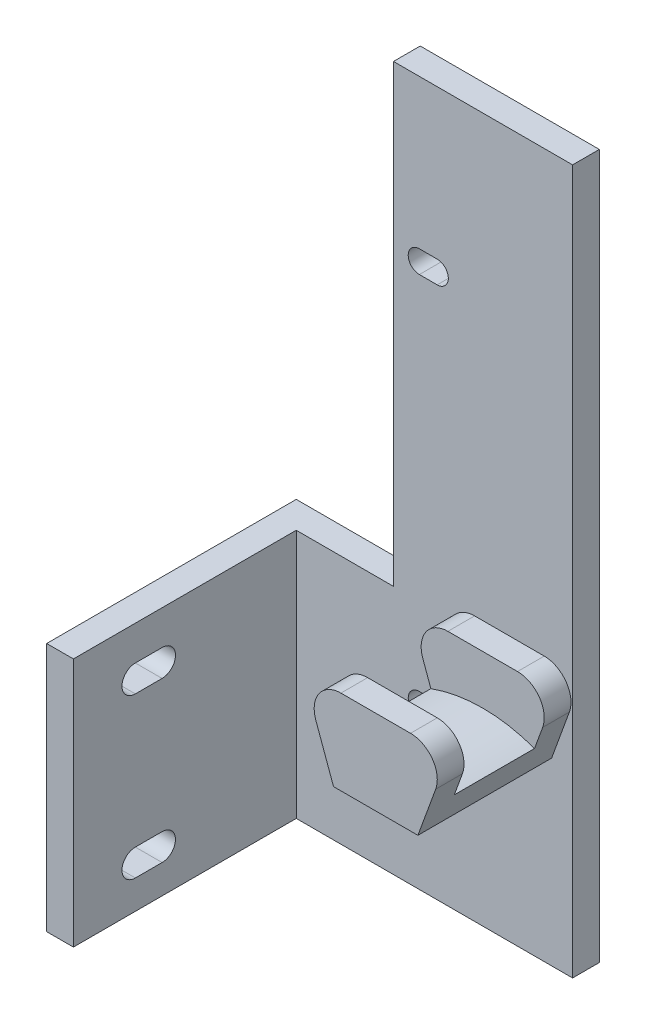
ISO-10303-21;
HEADER;
FILE_DESCRIPTION(('STEP AP214'),'2;1');
FILE_NAME('part.step','',(''),(''),'','','');
FILE_SCHEMA(('AUTOMOTIVE_DESIGN { 1 0 10303 214 1 1 1 1 }'));
ENDSEC;
DATA;
#1=APPLICATION_CONTEXT('core data for automotive mechanical design processes');
#2=APPLICATION_PROTOCOL_DEFINITION('international standard','automotive_design',2000,#1);
#3=PRODUCT_CONTEXT('',#1,'mechanical');
#4=PRODUCT('Part','Part','',(#3));
#5=PRODUCT_RELATED_PRODUCT_CATEGORY('part','',(#4));
#6=PRODUCT_DEFINITION_FORMATION('','',#4);
#7=PRODUCT_DEFINITION_CONTEXT('part definition',#1,'design');
#8=PRODUCT_DEFINITION('design','',#6,#7);
#9=PRODUCT_DEFINITION_SHAPE('','',#8);
#10=(LENGTH_UNIT() NAMED_UNIT(*) SI_UNIT(.MILLI.,.METRE.));
#11=(NAMED_UNIT(*) PLANE_ANGLE_UNIT() SI_UNIT($,.RADIAN.));
#12=(NAMED_UNIT(*) SI_UNIT($,.STERADIAN.) SOLID_ANGLE_UNIT());
#13=UNCERTAINTY_MEASURE_WITH_UNIT(LENGTH_MEASURE(1.E-05),#10,'distance_accuracy_value','');
#14=(GEOMETRIC_REPRESENTATION_CONTEXT(3) GLOBAL_UNCERTAINTY_ASSIGNED_CONTEXT((#13)) GLOBAL_UNIT_ASSIGNED_CONTEXT((#10,
#11,#12)) REPRESENTATION_CONTEXT('',''));
#15=CARTESIAN_POINT('',(0.,0.,0.));
#16=DIRECTION('',(0.,0.,1.));
#17=DIRECTION('',(1.,0.,0.));
#18=AXIS2_PLACEMENT_3D('',#15,#16,#17);
#19=CARTESIAN_POINT('',(0.,0.,3.));
#20=DIRECTION('',(0.,0.,1.));
#21=DIRECTION('',(1.,0.,0.));
#22=AXIS2_PLACEMENT_3D('',#19,#20,#21);
#23=PLANE('',#22);
#24=CARTESIAN_POINT('',(-17.1899572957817,-18.,3.));
#25=DIRECTION('',(0.,0.,1.));
#26=DIRECTION('',(1.,0.,0.));
#27=AXIS2_PLACEMENT_3D('',#24,#25,#26);
#28=CIRCLE('',#27,1.25);
#29=CARTESIAN_POINT('',(-17.1899572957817,-16.75,3.));
#30=VERTEX_POINT('',#29);
#31=CARTESIAN_POINT('',(-17.1899572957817,-19.25,3.));
#32=VERTEX_POINT('',#31);
#33=EDGE_CURVE('E336',#30,#32,#28,.T.);
#34=ORIENTED_EDGE('',*,*,#33,.F.);
#35=DIRECTION('',(-1.,0.,0.));
#36=VECTOR('',#35,1.);
#37=CARTESIAN_POINT('',(0.,-16.75,3.));
#38=LINE('',#37,#36);
#39=CARTESIAN_POINT('',(-15.1899572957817,-16.75,3.));
#40=VERTEX_POINT('',#39);
#41=EDGE_CURVE('E331',#40,#30,#38,.T.);
#42=ORIENTED_EDGE('',*,*,#41,.F.);
#43=CARTESIAN_POINT('',(-15.1899572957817,-18.,3.));
#44=DIRECTION('',(0.,0.,1.));
#45=DIRECTION('',(1.,0.,0.));
#46=AXIS2_PLACEMENT_3D('',#43,#44,#45);
#47=CIRCLE('',#46,1.25);
#48=CARTESIAN_POINT('',(-15.1899572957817,-19.25,3.));
#49=VERTEX_POINT('',#48);
#50=EDGE_CURVE('E279',#49,#40,#47,.T.);
#51=ORIENTED_EDGE('',*,*,#50,.F.);
#52=DIRECTION('',(1.,0.,0.));
#53=VECTOR('',#52,1.);
#54=CARTESIAN_POINT('',(0.,-19.25,3.));
#55=LINE('',#54,#53);
#56=EDGE_CURVE('E334',#32,#49,#55,.T.);
#57=ORIENTED_EDGE('',*,*,#56,.F.);
#58=EDGE_LOOP('',(#34,#42,#51,#57));
#59=FACE_BOUND('',#58,.T.);
#60=CARTESIAN_POINT('',(-17.1899572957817,-61.0102023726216,3.));
#61=DIRECTION('',(0.,0.,1.));
#62=DIRECTION('',(1.,0.,0.));
#63=AXIS2_PLACEMENT_3D('',#60,#61,#62);
#64=CIRCLE('',#63,1.25);
#65=CARTESIAN_POINT('',(-17.1899572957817,-59.7602023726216,3.));
#66=VERTEX_POINT('',#65);
#67=CARTESIAN_POINT('',(-17.1899572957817,-62.2602023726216,3.));
#68=VERTEX_POINT('',#67);
#69=EDGE_CURVE('E329',#66,#68,#64,.T.);
#70=ORIENTED_EDGE('',*,*,#69,.F.);
#71=DIRECTION('',(-1.,0.,0.));
#72=VECTOR('',#71,1.);
#73=CARTESIAN_POINT('',(0.,-59.7602023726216,3.));
#74=LINE('',#73,#72);
#75=CARTESIAN_POINT('',(-15.1899572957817,-59.7602023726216,3.));
#76=VERTEX_POINT('',#75);
#77=EDGE_CURVE('E303',#76,#66,#74,.T.);
#78=ORIENTED_EDGE('',*,*,#77,.F.);
#79=CARTESIAN_POINT('',(-15.1899572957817,-61.0102023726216,3.));
#80=DIRECTION('',(0.,0.,1.));
#81=DIRECTION('',(1.,0.,0.));
#82=AXIS2_PLACEMENT_3D('',#79,#80,#81);
#83=CIRCLE('',#82,1.25);
#84=CARTESIAN_POINT('',(-15.1899572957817,-62.2602023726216,3.));
#85=VERTEX_POINT('',#84);
#86=EDGE_CURVE('E325',#85,#76,#83,.T.);
#87=ORIENTED_EDGE('',*,*,#86,.F.);
#88=DIRECTION('',(1.,0.,0.));
#89=VECTOR('',#88,1.);
#90=CARTESIAN_POINT('',(0.,-62.2602023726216,3.));
#91=LINE('',#90,#89);
#92=EDGE_CURVE('E327',#68,#85,#91,.T.);
#93=ORIENTED_EDGE('',*,*,#92,.F.);
#94=EDGE_LOOP('',(#70,#78,#87,#93));
#95=FACE_BOUND('',#94,.T.);
#96=DIRECTION('',(0.,1.,0.));
#97=VECTOR('',#96,1.);
#98=CARTESIAN_POINT('',(-20.0928276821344,0.,3.));
#99=LINE('',#98,#97);
#100=CARTESIAN_POINT('',(-20.0928276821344,-51.,3.));
#101=VERTEX_POINT('',#100);
#102=CARTESIAN_POINT('',(-20.0928276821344,0.,3.));
#103=VERTEX_POINT('',#102);
#104=EDGE_CURVE('E405',#101,#103,#99,.T.);
#105=ORIENTED_EDGE('',*,*,#104,.F.);
#106=DIRECTION('',(1.,0.,0.));
#107=VECTOR('',#106,1.);
#108=CARTESIAN_POINT('',(-34.,-51.,3.));
#109=LINE('',#108,#107);
#110=CARTESIAN_POINT('',(-31.,-51.,3.));
#111=VERTEX_POINT('',#110);
#112=EDGE_CURVE('E402',#111,#101,#109,.T.);
#113=ORIENTED_EDGE('',*,*,#112,.F.);
#114=DIRECTION('',(0.,1.,0.));
#115=VECTOR('',#114,1.);
#116=CARTESIAN_POINT('',(-31.,-51.,3.));
#117=LINE('',#116,#115);
#118=CARTESIAN_POINT('',(-31.,-79.,3.));
#119=VERTEX_POINT('',#118);
#120=EDGE_CURVE('E481',#119,#111,#117,.T.);
#121=ORIENTED_EDGE('',*,*,#120,.F.);
#122=DIRECTION('',(1.,0.,0.));
#123=VECTOR('',#122,1.);
#124=CARTESIAN_POINT('',(-34.,-79.,3.));
#125=LINE('',#124,#123);
#126=CARTESIAN_POINT('',(0.,-79.,3.));
#127=VERTEX_POINT('',#126);
#128=EDGE_CURVE('E522',#119,#127,#125,.T.);
#129=ORIENTED_EDGE('',*,*,#128,.T.);
#130=DIRECTION('',(0.,1.,0.));
#131=VECTOR('',#130,1.);
#132=CARTESIAN_POINT('',(0.,0.,3.));
#133=LINE('',#132,#131);
#134=CARTESIAN_POINT('',(0.,0.,3.));
#135=VERTEX_POINT('',#134);
#136=EDGE_CURVE('E524',#127,#135,#133,.T.);
#137=ORIENTED_EDGE('',*,*,#136,.T.);
#138=DIRECTION('',(-1.,0.,0.));
#139=VECTOR('',#138,1.);
#140=CARTESIAN_POINT('',(-34.,0.,3.));
#141=LINE('',#140,#139);
#142=EDGE_CURVE('E527',#135,#103,#141,.T.);
#143=ORIENTED_EDGE('',*,*,#142,.T.);
#144=EDGE_LOOP('',(#105,#113,#121,#129,#137,#143));
#145=FACE_BOUND('',#144,.T.);
#146=DIRECTION('',(-0.342020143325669,0.939692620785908,0.));
#147=VECTOR('',#146,1.);
#148=CARTESIAN_POINT('',(-29.3375655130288,-10.6780005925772,3.));
#149=LINE('',#148,#147);
#150=CARTESIAN_POINT('',(-11.81708744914,-58.8151184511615,3.));
#151=VERTEX_POINT('',#150);
#152=CARTESIAN_POINT('',(-13.8094385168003,-53.3411788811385,3.));
#153=VERTEX_POINT('',#152);
#154=EDGE_CURVE('E508',#151,#153,#149,.T.);
#155=ORIENTED_EDGE('',*,*,#154,.T.);
#156=CARTESIAN_POINT('',(-10.9903606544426,-52.3151184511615,3.));
#157=DIRECTION('',(0.,0.,1.));
#158=DIRECTION('',(1.,0.,0.));
#159=AXIS2_PLACEMENT_3D('',#156,#157,#158);
#160=CIRCLE('',#159,3.);
#161=CARTESIAN_POINT('',(-10.9903606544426,-49.3151184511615,3.));
#162=VERTEX_POINT('',#161);
#163=EDGE_CURVE('E416',#162,#153,#160,.T.);
#164=ORIENTED_EDGE('',*,*,#163,.F.);
#165=DIRECTION('',(-1.,0.,0.));
#166=VECTOR('',#165,1.);
#167=CARTESIAN_POINT('',(0.,-49.3151184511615,3.));
#168=LINE('',#167,#166);
#169=CARTESIAN_POINT('',(-3.18058815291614,-49.3151184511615,3.));
#170=VERTEX_POINT('',#169);
#171=EDGE_CURVE('E426',#170,#162,#168,.T.);
#172=ORIENTED_EDGE('',*,*,#171,.F.);
#173=CARTESIAN_POINT('',(-3.18058815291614,-52.3151184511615,3.));
#174=DIRECTION('',(0.,0.,1.));
#175=DIRECTION('',(1.,0.,0.));
#176=AXIS2_PLACEMENT_3D('',#173,#174,#175);
#177=CIRCLE('',#176,3.);
#178=CARTESIAN_POINT('',(-0.361510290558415,-53.3411788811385,3.));
#179=VERTEX_POINT('',#178);
#180=EDGE_CURVE('E411',#179,#170,#177,.T.);
#181=ORIENTED_EDGE('',*,*,#180,.F.);
#182=DIRECTION('',(0.34202014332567,0.939692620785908,0.));
#183=VECTOR('',#182,1.);
#184=CARTESIAN_POINT('',(16.8243028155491,-6.12354543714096,3.));
#185=LINE('',#184,#183);
#186=CARTESIAN_POINT('',(-2.35386135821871,-58.8151184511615,3.));
#187=VERTEX_POINT('',#186);
#188=EDGE_CURVE('E501',#187,#179,#185,.T.);
#189=ORIENTED_EDGE('',*,*,#188,.F.);
#190=DIRECTION('',(1.,0.,0.));
#191=VECTOR('',#190,1.);
#192=CARTESIAN_POINT('',(0.,-58.8151184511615,3.));
#193=LINE('',#192,#191);
#194=EDGE_CURVE('E506',#151,#187,#193,.T.);
#195=ORIENTED_EDGE('',*,*,#194,.F.);
#196=EDGE_LOOP('',(#155,#164,#172,#181,#189,#195));
#197=FACE_BOUND('',#196,.T.);
#198=ADVANCED_FACE('F41',(#59,#95,#145,#197),#23,.T.);
#199=CARTESIAN_POINT('',(-34.,0.,3.));
#200=DIRECTION('',(1.,0.,0.));
#201=DIRECTION('',(0.,1.,0.));
#202=AXIS2_PLACEMENT_3D('',#199,#200,#201);
#203=PLANE('',#202);
#204=DIRECTION('',(0.,0.,-1.));
#205=VECTOR('',#204,1.);
#206=CARTESIAN_POINT('',(-34.,-75.7561196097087,3.));
#207=LINE('',#206,#205);
#208=CARTESIAN_POINT('',(-34.,-75.7561196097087,21.05));
#209=VERTEX_POINT('',#208);
#210=CARTESIAN_POINT('',(-34.,-75.7561196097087,18.05));
#211=VERTEX_POINT('',#210);
#212=EDGE_CURVE('E396',#209,#211,#207,.T.);
#213=ORIENTED_EDGE('',*,*,#212,.T.);
#214=CARTESIAN_POINT('',(-34.,-74.2561196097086,18.05));
#215=DIRECTION('',(1.,0.,0.));
#216=DIRECTION('',(0.,1.,0.));
#217=AXIS2_PLACEMENT_3D('',#214,#215,#216);
#218=CIRCLE('',#217,1.5);
#219=CARTESIAN_POINT('',(-34.,-72.7561196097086,18.05));
#220=VERTEX_POINT('',#219);
#221=EDGE_CURVE('E399',#211,#220,#218,.T.);
#222=ORIENTED_EDGE('',*,*,#221,.T.);
#223=DIRECTION('',(0.,0.,1.));
#224=VECTOR('',#223,1.);
#225=CARTESIAN_POINT('',(-34.,-72.7561196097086,3.));
#226=LINE('',#225,#224);
#227=CARTESIAN_POINT('',(-34.,-72.7561196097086,21.05));
#228=VERTEX_POINT('',#227);
#229=EDGE_CURVE('E390',#220,#228,#226,.T.);
#230=ORIENTED_EDGE('',*,*,#229,.T.);
#231=CARTESIAN_POINT('',(-34.,-74.2561196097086,21.05));
#232=DIRECTION('',(1.,0.,0.));
#233=DIRECTION('',(0.,1.,0.));
#234=AXIS2_PLACEMENT_3D('',#231,#232,#233);
#235=CIRCLE('',#234,1.5);
#236=EDGE_CURVE('E393',#228,#209,#235,.T.);
#237=ORIENTED_EDGE('',*,*,#236,.T.);
#238=EDGE_LOOP('',(#213,#222,#230,#237));
#239=FACE_BOUND('',#238,.T.);
#240=DIRECTION('',(0.,0.,-1.));
#241=VECTOR('',#240,1.);
#242=CARTESIAN_POINT('',(-34.,-57.8702673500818,3.));
#243=LINE('',#242,#241);
#244=CARTESIAN_POINT('',(-34.,-57.8702673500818,21.05));
#245=VERTEX_POINT('',#244);
#246=CARTESIAN_POINT('',(-34.,-57.8702673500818,18.05));
#247=VERTEX_POINT('',#246);
#248=EDGE_CURVE('E384',#245,#247,#243,.T.);
#249=ORIENTED_EDGE('',*,*,#248,.T.);
#250=CARTESIAN_POINT('',(-34.,-56.3702673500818,18.05));
#251=DIRECTION('',(1.,0.,0.));
#252=DIRECTION('',(0.,1.,0.));
#253=AXIS2_PLACEMENT_3D('',#250,#251,#252);
#254=CIRCLE('',#253,1.5);
#255=CARTESIAN_POINT('',(-34.,-54.8702673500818,18.05));
#256=VERTEX_POINT('',#255);
#257=EDGE_CURVE('E387',#247,#256,#254,.T.);
#258=ORIENTED_EDGE('',*,*,#257,.T.);
#259=DIRECTION('',(0.,0.,1.));
#260=VECTOR('',#259,1.);
#261=CARTESIAN_POINT('',(-34.,-54.8702673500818,3.));
#262=LINE('',#261,#260);
#263=CARTESIAN_POINT('',(-34.,-54.8702673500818,21.05));
#264=VERTEX_POINT('',#263);
#265=EDGE_CURVE('E354',#256,#264,#262,.T.);
#266=ORIENTED_EDGE('',*,*,#265,.T.);
#267=CARTESIAN_POINT('',(-34.,-56.3702673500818,21.05));
#268=DIRECTION('',(1.,0.,0.));
#269=DIRECTION('',(0.,1.,0.));
#270=AXIS2_PLACEMENT_3D('',#267,#268,#269);
#271=CIRCLE('',#270,1.5);
#272=EDGE_CURVE('E381',#264,#245,#271,.T.);
#273=ORIENTED_EDGE('',*,*,#272,.T.);
#274=EDGE_LOOP('',(#249,#258,#266,#273));
#275=FACE_BOUND('',#274,.T.);
#276=DIRECTION('',(0.,0.,-1.));
#277=VECTOR('',#276,1.);
#278=CARTESIAN_POINT('',(-34.,-51.,28.));
#279=LINE('',#278,#277);
#280=CARTESIAN_POINT('',(-34.,-51.,28.));
#281=VERTEX_POINT('',#280);
#282=CARTESIAN_POINT('',(-34.,-51.,0.));
#283=VERTEX_POINT('',#282);
#284=EDGE_CURVE('E491',#281,#283,#279,.T.);
#285=ORIENTED_EDGE('',*,*,#284,.T.);
#286=DIRECTION('',(0.,-1.,0.));
#287=VECTOR('',#286,1.);
#288=CARTESIAN_POINT('',(-34.,0.,0.));
#289=LINE('',#288,#287);
#290=CARTESIAN_POINT('',(-34.,-79.,0.));
#291=VERTEX_POINT('',#290);
#292=EDGE_CURVE('E521',#283,#291,#289,.T.);
#293=ORIENTED_EDGE('',*,*,#292,.T.);
#294=DIRECTION('',(0.,0.,-1.));
#295=VECTOR('',#294,1.);
#296=CARTESIAN_POINT('',(-34.,-79.,3.));
#297=LINE('',#296,#295);
#298=CARTESIAN_POINT('',(-34.,-79.,28.));
#299=VERTEX_POINT('',#298);
#300=EDGE_CURVE('E543',#299,#291,#297,.T.);
#301=ORIENTED_EDGE('',*,*,#300,.F.);
#302=DIRECTION('',(0.,-1.,0.));
#303=VECTOR('',#302,1.);
#304=CARTESIAN_POINT('',(-34.,-51.,28.));
#305=LINE('',#304,#303);
#306=EDGE_CURVE('E482',#281,#299,#305,.T.);
#307=ORIENTED_EDGE('',*,*,#306,.F.);
#308=EDGE_LOOP('',(#285,#293,#301,#307));
#309=FACE_BOUND('',#308,.T.);
#310=ADVANCED_FACE('F43',(#239,#275,#309),#203,.F.);
#311=CARTESIAN_POINT('',(-34.,-79.,3.));
#312=DIRECTION('',(0.,1.,0.));
#313=DIRECTION('',(0.,0.,1.));
#314=AXIS2_PLACEMENT_3D('',#311,#312,#313);
#315=PLANE('',#314);
#316=DIRECTION('',(1.,0.,0.));
#317=VECTOR('',#316,1.);
#318=CARTESIAN_POINT('',(-34.,-79.,0.));
#319=LINE('',#318,#317);
#320=CARTESIAN_POINT('',(0.,-79.,0.));
#321=VERTEX_POINT('',#320);
#322=EDGE_CURVE('E532',#291,#321,#319,.T.);
#323=ORIENTED_EDGE('',*,*,#322,.T.);
#324=DIRECTION('',(0.,0.,-1.));
#325=VECTOR('',#324,1.);
#326=CARTESIAN_POINT('',(0.,-79.,3.));
#327=LINE('',#326,#325);
#328=EDGE_CURVE('E540',#127,#321,#327,.T.);
#329=ORIENTED_EDGE('',*,*,#328,.F.);
#330=ORIENTED_EDGE('',*,*,#128,.F.);
#331=DIRECTION('',(0.,0.,-1.));
#332=VECTOR('',#331,1.);
#333=CARTESIAN_POINT('',(-31.,-79.,28.));
#334=LINE('',#333,#332);
#335=CARTESIAN_POINT('',(-31.,-79.,28.));
#336=VERTEX_POINT('',#335);
#337=EDGE_CURVE('E498',#336,#119,#334,.T.);
#338=ORIENTED_EDGE('',*,*,#337,.F.);
#339=DIRECTION('',(1.,0.,0.));
#340=VECTOR('',#339,1.);
#341=CARTESIAN_POINT('',(-34.,-79.,28.));
#342=LINE('',#341,#340);
#343=EDGE_CURVE('E485',#299,#336,#342,.T.);
#344=ORIENTED_EDGE('',*,*,#343,.F.);
#345=ORIENTED_EDGE('',*,*,#300,.T.);
#346=EDGE_LOOP('',(#323,#329,#330,#338,#344,#345));
#347=FACE_BOUND('',#346,.T.);
#348=ADVANCED_FACE('F574',(#347),#315,.F.);
#349=CARTESIAN_POINT('',(0.,0.,3.));
#350=DIRECTION('',(-1.,0.,0.));
#351=DIRECTION('',(0.,-1.,0.));
#352=AXIS2_PLACEMENT_3D('',#349,#350,#351);
#353=PLANE('',#352);
#354=DIRECTION('',(0.,1.,0.));
#355=VECTOR('',#354,1.);
#356=CARTESIAN_POINT('',(0.,0.,0.));
#357=LINE('',#356,#355);
#358=CARTESIAN_POINT('',(0.,0.,0.));
#359=VERTEX_POINT('',#358);
#360=EDGE_CURVE('E534',#321,#359,#357,.T.);
#361=ORIENTED_EDGE('',*,*,#360,.T.);
#362=DIRECTION('',(0.,0.,-1.));
#363=VECTOR('',#362,1.);
#364=CARTESIAN_POINT('',(0.,0.,3.));
#365=LINE('',#364,#363);
#366=EDGE_CURVE('E530',#135,#359,#365,.T.);
#367=ORIENTED_EDGE('',*,*,#366,.F.);
#368=ORIENTED_EDGE('',*,*,#136,.F.);
#369=ORIENTED_EDGE('',*,*,#328,.T.);
#370=EDGE_LOOP('',(#361,#367,#368,#369));
#371=FACE_BOUND('',#370,.T.);
#372=ADVANCED_FACE('F570',(#371),#353,.F.);
#373=CARTESIAN_POINT('',(-34.,0.,3.));
#374=DIRECTION('',(0.,-1.,0.));
#375=DIRECTION('',(0.,0.,-1.));
#376=AXIS2_PLACEMENT_3D('',#373,#374,#375);
#377=PLANE('',#376);
#378=DIRECTION('',(-1.,0.,0.));
#379=VECTOR('',#378,1.);
#380=CARTESIAN_POINT('',(-34.,0.,0.));
#381=LINE('',#380,#379);
#382=CARTESIAN_POINT('',(-20.0928276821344,0.,0.));
#383=VERTEX_POINT('',#382);
#384=EDGE_CURVE('E525',#359,#383,#381,.T.);
#385=ORIENTED_EDGE('',*,*,#384,.T.);
#386=DIRECTION('',(0.,0.,1.));
#387=VECTOR('',#386,1.);
#388=CARTESIAN_POINT('',(-20.0928276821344,0.,-7.));
#389=LINE('',#388,#387);
#390=EDGE_CURVE('E408',#383,#103,#389,.T.);
#391=ORIENTED_EDGE('',*,*,#390,.T.);
#392=ORIENTED_EDGE('',*,*,#142,.F.);
#393=ORIENTED_EDGE('',*,*,#366,.T.);
#394=EDGE_LOOP('',(#385,#391,#392,#393));
#395=FACE_BOUND('',#394,.T.);
#396=ADVANCED_FACE('F562',(#395),#377,.F.);
#397=CARTESIAN_POINT('',(0.,0.,0.));
#398=DIRECTION('',(0.,0.,1.));
#399=DIRECTION('',(1.,0.,0.));
#400=AXIS2_PLACEMENT_3D('',#397,#398,#399);
#401=PLANE('',#400);
#402=DIRECTION('',(1.,0.,0.));
#403=VECTOR('',#402,1.);
#404=CARTESIAN_POINT('',(-17.1899572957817,-16.75,0.));
#405=LINE('',#404,#403);
#406=CARTESIAN_POINT('',(-17.1899572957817,-16.75,0.));
#407=VERTEX_POINT('',#406);
#408=CARTESIAN_POINT('',(-15.1899572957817,-16.75,0.));
#409=VERTEX_POINT('',#408);
#410=EDGE_CURVE('E286',#407,#409,#405,.T.);
#411=ORIENTED_EDGE('',*,*,#410,.F.);
#412=CARTESIAN_POINT('',(-17.1899572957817,-18.,0.));
#413=DIRECTION('',(0.,0.,-1.));
#414=DIRECTION('',(-1.,0.,0.));
#415=AXIS2_PLACEMENT_3D('',#412,#413,#414);
#416=CIRCLE('',#415,1.25);
#417=CARTESIAN_POINT('',(-17.1899572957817,-19.25,0.));
#418=VERTEX_POINT('',#417);
#419=EDGE_CURVE('E291',#418,#407,#416,.T.);
#420=ORIENTED_EDGE('',*,*,#419,.F.);
#421=DIRECTION('',(-1.,0.,0.));
#422=VECTOR('',#421,1.);
#423=CARTESIAN_POINT('',(-17.1899572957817,-19.25,0.));
#424=LINE('',#423,#422);
#425=CARTESIAN_POINT('',(-15.1899572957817,-19.25,0.));
#426=VERTEX_POINT('',#425);
#427=EDGE_CURVE('E296',#426,#418,#424,.T.);
#428=ORIENTED_EDGE('',*,*,#427,.F.);
#429=CARTESIAN_POINT('',(-15.1899572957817,-18.,0.));
#430=DIRECTION('',(0.,0.,-1.));
#431=DIRECTION('',(-1.,0.,0.));
#432=AXIS2_PLACEMENT_3D('',#429,#430,#431);
#433=CIRCLE('',#432,1.25);
#434=EDGE_CURVE('E276',#409,#426,#433,.T.);
#435=ORIENTED_EDGE('',*,*,#434,.F.);
#436=EDGE_LOOP('',(#411,#420,#428,#435));
#437=FACE_BOUND('',#436,.T.);
#438=DIRECTION('',(1.,0.,0.));
#439=VECTOR('',#438,1.);
#440=CARTESIAN_POINT('',(-17.1899572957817,-59.7602023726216,0.));
#441=LINE('',#440,#439);
#442=CARTESIAN_POINT('',(-17.1899572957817,-59.7602023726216,0.));
#443=VERTEX_POINT('',#442);
#444=CARTESIAN_POINT('',(-15.1899572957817,-59.7602023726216,0.));
#445=VERTEX_POINT('',#444);
#446=EDGE_CURVE('E308',#443,#445,#441,.T.);
#447=ORIENTED_EDGE('',*,*,#446,.F.);
#448=CARTESIAN_POINT('',(-17.1899572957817,-61.0102023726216,0.));
#449=DIRECTION('',(0.,0.,-1.));
#450=DIRECTION('',(1.,0.,0.));
#451=AXIS2_PLACEMENT_3D('',#448,#449,#450);
#452=CIRCLE('',#451,1.25);
#453=CARTESIAN_POINT('',(-17.1899572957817,-62.2602023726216,0.));
#454=VERTEX_POINT('',#453);
#455=EDGE_CURVE('E306',#454,#443,#452,.T.);
#456=ORIENTED_EDGE('',*,*,#455,.F.);
#457=DIRECTION('',(-1.,0.,0.));
#458=VECTOR('',#457,1.);
#459=CARTESIAN_POINT('',(-17.1899572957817,-62.2602023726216,0.));
#460=LINE('',#459,#458);
#461=CARTESIAN_POINT('',(-15.1899572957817,-62.2602023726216,0.));
#462=VERTEX_POINT('',#461);
#463=EDGE_CURVE('E313',#462,#454,#460,.T.);
#464=ORIENTED_EDGE('',*,*,#463,.F.);
#465=CARTESIAN_POINT('',(-15.1899572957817,-61.0102023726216,0.));
#466=DIRECTION('',(0.,0.,-1.));
#467=DIRECTION('',(1.,0.,0.));
#468=AXIS2_PLACEMENT_3D('',#465,#466,#467);
#469=CIRCLE('',#468,1.25);
#470=EDGE_CURVE('E310',#445,#462,#469,.T.);
#471=ORIENTED_EDGE('',*,*,#470,.F.);
#472=EDGE_LOOP('',(#447,#456,#464,#471));
#473=FACE_BOUND('',#472,.T.);
#474=DIRECTION('',(1.,0.,0.));
#475=VECTOR('',#474,1.);
#476=CARTESIAN_POINT('',(0.,-51.,0.));
#477=LINE('',#476,#475);
#478=CARTESIAN_POINT('',(-20.0928276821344,-51.,0.));
#479=VERTEX_POINT('',#478);
#480=EDGE_CURVE('E49',#283,#479,#477,.T.);
#481=ORIENTED_EDGE('',*,*,#480,.T.);
#482=DIRECTION('',(0.,1.,0.));
#483=VECTOR('',#482,1.);
#484=CARTESIAN_POINT('',(-20.0928276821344,0.,0.));
#485=LINE('',#484,#483);
#486=EDGE_CURVE('E11',#479,#383,#485,.T.);
#487=ORIENTED_EDGE('',*,*,#486,.T.);
#488=ORIENTED_EDGE('',*,*,#384,.F.);
#489=ORIENTED_EDGE('',*,*,#360,.F.);
#490=ORIENTED_EDGE('',*,*,#322,.F.);
#491=ORIENTED_EDGE('',*,*,#292,.F.);
#492=EDGE_LOOP('',(#481,#487,#488,#489,#490,#491));
#493=FACE_BOUND('',#492,.T.);
#494=ADVANCED_FACE('F293',(#437,#473,#493),#401,.F.);
#495=CARTESIAN_POINT('',(16.8243028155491,-6.12354543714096,15.));
#496=DIRECTION('',(-0.939692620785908,0.34202014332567,0.));
#497=DIRECTION('',(-0.34202014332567,-0.939692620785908,0.));
#498=AXIS2_PLACEMENT_3D('',#495,#496,#497);
#499=PLANE('',#498);
#500=DIRECTION('',(0.,0.,-1.));
#501=VECTOR('',#500,1.);
#502=CARTESIAN_POINT('',(-2.35386135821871,-58.8151184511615,15.));
#503=LINE('',#502,#501);
#504=CARTESIAN_POINT('',(-2.35386135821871,-58.8151184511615,18.));
#505=VERTEX_POINT('',#504);
#506=EDGE_CURVE('E505',#505,#187,#503,.T.);
#507=ORIENTED_EDGE('',*,*,#506,.T.);
#508=ORIENTED_EDGE('',*,*,#188,.T.);
#509=DIRECTION('',(0.,0.,-1.));
#510=VECTOR('',#509,1.);
#511=CARTESIAN_POINT('',(-0.361510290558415,-53.3411788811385,6.));
#512=LINE('',#511,#510);
#513=CARTESIAN_POINT('',(-0.361510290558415,-53.3411788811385,6.));
#514=VERTEX_POINT('',#513);
#515=EDGE_CURVE('E438',#514,#179,#512,.T.);
#516=ORIENTED_EDGE('',*,*,#515,.F.);
#517=DIRECTION('',(0.342020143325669,0.939692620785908,0.));
#518=VECTOR('',#517,1.);
#519=CARTESIAN_POINT('',(16.8243028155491,-6.12354543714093,6.));
#520=LINE('',#519,#518);
#521=CARTESIAN_POINT('',(-1.27113196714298,-55.8403438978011,6.));
#522=VERTEX_POINT('',#521);
#523=EDGE_CURVE('E415',#522,#514,#520,.T.);
#524=ORIENTED_EDGE('',*,*,#523,.F.);
#525=DIRECTION('',(0.,0.,-1.));
#526=VECTOR('',#525,1.);
#527=CARTESIAN_POINT('',(-1.27113196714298,-55.8403438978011,15.));
#528=LINE('',#527,#526);
#529=CARTESIAN_POINT('',(-1.27113196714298,-55.8403438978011,15.));
#530=VERTEX_POINT('',#529);
#531=EDGE_CURVE('E518',#530,#522,#528,.T.);
#532=ORIENTED_EDGE('',*,*,#531,.F.);
#533=DIRECTION('',(0.342020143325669,0.939692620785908,0.));
#534=VECTOR('',#533,1.);
#535=CARTESIAN_POINT('',(-2.35386135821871,-58.8151184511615,15.));
#536=LINE('',#535,#534);
#537=CARTESIAN_POINT('',(-0.361510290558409,-53.3411788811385,15.));
#538=VERTEX_POINT('',#537);
#539=EDGE_CURVE('E463',#530,#538,#536,.T.);
#540=ORIENTED_EDGE('',*,*,#539,.T.);
#541=DIRECTION('',(0.,0.,-1.));
#542=VECTOR('',#541,1.);
#543=CARTESIAN_POINT('',(-0.361510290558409,-53.3411788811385,18.));
#544=LINE('',#543,#542);
#545=CARTESIAN_POINT('',(-0.361510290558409,-53.3411788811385,18.));
#546=VERTEX_POINT('',#545);
#547=EDGE_CURVE('E478',#546,#538,#544,.T.);
#548=ORIENTED_EDGE('',*,*,#547,.F.);
#549=DIRECTION('',(0.342020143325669,0.939692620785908,0.));
#550=VECTOR('',#549,1.);
#551=CARTESIAN_POINT('',(-2.35386135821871,-58.8151184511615,18.));
#552=LINE('',#551,#550);
#553=EDGE_CURVE('E452',#505,#546,#552,.T.);
#554=ORIENTED_EDGE('',*,*,#553,.F.);
#555=EDGE_LOOP('',(#507,#508,#516,#524,#532,#540,#548,#554));
#556=FACE_BOUND('',#555,.T.);
#557=ADVANCED_FACE('F610',(#556),#499,.F.);
#558=CARTESIAN_POINT('',(-7.08547440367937,-71.8151184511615,15.));
#559=DIRECTION('',(0.,0.,-1.));
#560=DIRECTION('',(-1.,0.,0.));
#561=AXIS2_PLACEMENT_3D('',#558,#559,#560);
#562=CYLINDRICAL_SURFACE('',#561,17.);
#563=ORIENTED_EDGE('',*,*,#531,.T.);
#564=CARTESIAN_POINT('',(-7.08547440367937,-71.8151184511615,6.));
#565=DIRECTION('',(0.,0.,1.));
#566=DIRECTION('',(1.,0.,0.));
#567=AXIS2_PLACEMENT_3D('',#564,#565,#566);
#568=CIRCLE('',#567,17.);
#569=CARTESIAN_POINT('',(-12.8998168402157,-55.8403438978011,6.));
#570=VERTEX_POINT('',#569);
#571=EDGE_CURVE('E441',#522,#570,#568,.T.);
#572=ORIENTED_EDGE('',*,*,#571,.T.);
#573=DIRECTION('',(0.,0.,-1.));
#574=VECTOR('',#573,1.);
#575=CARTESIAN_POINT('',(-12.8998168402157,-55.8403438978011,15.));
#576=LINE('',#575,#574);
#577=CARTESIAN_POINT('',(-12.8998168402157,-55.8403438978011,15.));
#578=VERTEX_POINT('',#577);
#579=EDGE_CURVE('E515',#578,#570,#576,.T.);
#580=ORIENTED_EDGE('',*,*,#579,.F.);
#581=CARTESIAN_POINT('',(-7.08547440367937,-71.8151184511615,15.));
#582=DIRECTION('',(0.,0.,1.));
#583=DIRECTION('',(1.,0.,0.));
#584=AXIS2_PLACEMENT_3D('',#581,#582,#583);
#585=CIRCLE('',#584,17.);
#586=EDGE_CURVE('E502',#530,#578,#585,.T.);
#587=ORIENTED_EDGE('',*,*,#586,.F.);
#588=EDGE_LOOP('',(#563,#572,#580,#587));
#589=FACE_BOUND('',#588,.T.);
#590=ADVANCED_FACE('F646',(#589),#562,.T.);
#591=CARTESIAN_POINT('',(-29.3375655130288,-10.6780005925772,15.));
#592=DIRECTION('',(-0.939692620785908,-0.342020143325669,0.));
#593=DIRECTION('',(0.342020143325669,-0.939692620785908,0.));
#594=AXIS2_PLACEMENT_3D('',#591,#592,#593);
#595=PLANE('',#594);
#596=ORIENTED_EDGE('',*,*,#579,.T.);
#597=DIRECTION('',(0.342020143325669,-0.939692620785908,0.));
#598=VECTOR('',#597,1.);
#599=CARTESIAN_POINT('',(-29.3375655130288,-10.6780005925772,6.));
#600=LINE('',#599,#598);
#601=CARTESIAN_POINT('',(-13.8094385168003,-53.3411788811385,6.));
#602=VERTEX_POINT('',#601);
#603=EDGE_CURVE('E413',#602,#570,#600,.T.);
#604=ORIENTED_EDGE('',*,*,#603,.F.);
#605=DIRECTION('',(0.,0.,-1.));
#606=VECTOR('',#605,1.);
#607=CARTESIAN_POINT('',(-13.8094385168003,-53.3411788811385,6.));
#608=LINE('',#607,#606);
#609=EDGE_CURVE('E424',#602,#153,#608,.T.);
#610=ORIENTED_EDGE('',*,*,#609,.T.);
#611=ORIENTED_EDGE('',*,*,#154,.F.);
#612=DIRECTION('',(0.,0.,-1.));
#613=VECTOR('',#612,1.);
#614=CARTESIAN_POINT('',(-11.81708744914,-58.8151184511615,15.));
#615=LINE('',#614,#613);
#616=CARTESIAN_POINT('',(-11.81708744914,-58.8151184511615,18.));
#617=VERTEX_POINT('',#616);
#618=EDGE_CURVE('E513',#617,#151,#615,.T.);
#619=ORIENTED_EDGE('',*,*,#618,.F.);
#620=DIRECTION('',(0.342020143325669,-0.939692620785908,0.));
#621=VECTOR('',#620,1.);
#622=CARTESIAN_POINT('',(-13.8094385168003,-53.3411788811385,18.));
#623=LINE('',#622,#621);
#624=CARTESIAN_POINT('',(-13.8094385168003,-53.3411788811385,18.));
#625=VERTEX_POINT('',#624);
#626=EDGE_CURVE('E445',#625,#617,#623,.T.);
#627=ORIENTED_EDGE('',*,*,#626,.F.);
#628=DIRECTION('',(0.,0.,-1.));
#629=VECTOR('',#628,1.);
#630=CARTESIAN_POINT('',(-13.8094385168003,-53.3411788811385,18.));
#631=LINE('',#630,#629);
#632=CARTESIAN_POINT('',(-13.8094385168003,-53.3411788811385,15.));
#633=VERTEX_POINT('',#632);
#634=EDGE_CURVE('E460',#625,#633,#631,.T.);
#635=ORIENTED_EDGE('',*,*,#634,.T.);
#636=DIRECTION('',(0.342020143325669,-0.939692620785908,0.));
#637=VECTOR('',#636,1.);
#638=CARTESIAN_POINT('',(-13.8094385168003,-53.3411788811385,15.));
#639=LINE('',#638,#637);
#640=EDGE_CURVE('E444',#633,#578,#639,.T.);
#641=ORIENTED_EDGE('',*,*,#640,.T.);
#642=EDGE_LOOP('',(#596,#604,#610,#611,#619,#627,#635,#641));
#643=FACE_BOUND('',#642,.T.);
#644=ADVANCED_FACE('F592',(#643),#595,.T.);
#645=CARTESIAN_POINT('',(0.,-58.8151184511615,15.));
#646=DIRECTION('',(0.,1.,0.));
#647=DIRECTION('',(0.,0.,1.));
#648=AXIS2_PLACEMENT_3D('',#645,#646,#647);
#649=PLANE('',#648);
#650=ORIENTED_EDGE('',*,*,#618,.T.);
#651=ORIENTED_EDGE('',*,*,#194,.T.);
#652=ORIENTED_EDGE('',*,*,#506,.F.);
#653=DIRECTION('',(1.,0.,0.));
#654=VECTOR('',#653,1.);
#655=CARTESIAN_POINT('',(-11.81708744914,-58.8151184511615,18.));
#656=LINE('',#655,#654);
#657=EDGE_CURVE('E448',#617,#505,#656,.T.);
#658=ORIENTED_EDGE('',*,*,#657,.F.);
#659=EDGE_LOOP('',(#650,#651,#652,#658));
#660=FACE_BOUND('',#659,.T.);
#661=ADVANCED_FACE('F584',(#660),#649,.F.);
#662=CARTESIAN_POINT('',(-31.,-51.,28.));
#663=DIRECTION('',(-1.,0.,0.));
#664=DIRECTION('',(0.,-1.,0.));
#665=AXIS2_PLACEMENT_3D('',#662,#663,#664);
#666=PLANE('',#665);
#667=DIRECTION('',(0.,0.,1.));
#668=VECTOR('',#667,1.);
#669=CARTESIAN_POINT('',(-31.,-72.7561196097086,18.05));
#670=LINE('',#669,#668);
#671=CARTESIAN_POINT('',(-31.,-72.7561196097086,18.05));
#672=VERTEX_POINT('',#671);
#673=CARTESIAN_POINT('',(-31.,-72.7561196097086,21.05));
#674=VERTEX_POINT('',#673);
#675=EDGE_CURVE('E341',#672,#674,#670,.T.);
#676=ORIENTED_EDGE('',*,*,#675,.F.);
#677=CARTESIAN_POINT('',(-31.,-74.2561196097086,18.05));
#678=DIRECTION('',(1.,0.,0.));
#679=DIRECTION('',(0.,1.,0.));
#680=AXIS2_PLACEMENT_3D('',#677,#678,#679);
#681=CIRCLE('',#680,1.5);
#682=CARTESIAN_POINT('',(-31.,-75.7561196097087,18.05));
#683=VERTEX_POINT('',#682);
#684=EDGE_CURVE('E339',#683,#672,#681,.T.);
#685=ORIENTED_EDGE('',*,*,#684,.F.);
#686=DIRECTION('',(0.,0.,-1.));
#687=VECTOR('',#686,1.);
#688=CARTESIAN_POINT('',(-31.,-75.7561196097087,18.05));
#689=LINE('',#688,#687);
#690=CARTESIAN_POINT('',(-31.,-75.7561196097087,21.05));
#691=VERTEX_POINT('',#690);
#692=EDGE_CURVE('E348',#691,#683,#689,.T.);
#693=ORIENTED_EDGE('',*,*,#692,.F.);
#694=CARTESIAN_POINT('',(-31.,-74.2561196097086,21.05));
#695=DIRECTION('',(1.,0.,0.));
#696=DIRECTION('',(0.,1.,0.));
#697=AXIS2_PLACEMENT_3D('',#694,#695,#696);
#698=CIRCLE('',#697,1.5);
#699=EDGE_CURVE('E345',#674,#691,#698,.T.);
#700=ORIENTED_EDGE('',*,*,#699,.F.);
#701=EDGE_LOOP('',(#676,#685,#693,#700));
#702=FACE_BOUND('',#701,.T.);
#703=DIRECTION('',(0.,0.,1.));
#704=VECTOR('',#703,1.);
#705=CARTESIAN_POINT('',(-31.,-54.8702673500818,18.05));
#706=LINE('',#705,#704);
#707=CARTESIAN_POINT('',(-31.,-54.8702673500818,18.05));
#708=VERTEX_POINT('',#707);
#709=CARTESIAN_POINT('',(-31.,-54.8702673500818,21.05));
#710=VERTEX_POINT('',#709);
#711=EDGE_CURVE('E362',#708,#710,#706,.T.);
#712=ORIENTED_EDGE('',*,*,#711,.F.);
#713=CARTESIAN_POINT('',(-31.,-56.3702673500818,18.05));
#714=DIRECTION('',(1.,0.,0.));
#715=DIRECTION('',(0.,-1.,0.));
#716=AXIS2_PLACEMENT_3D('',#713,#714,#715);
#717=CIRCLE('',#716,1.5);
#718=CARTESIAN_POINT('',(-31.,-57.8702673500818,18.05));
#719=VERTEX_POINT('',#718);
#720=EDGE_CURVE('E338',#719,#708,#717,.T.);
#721=ORIENTED_EDGE('',*,*,#720,.F.);
#722=DIRECTION('',(0.,0.,-1.));
#723=VECTOR('',#722,1.);
#724=CARTESIAN_POINT('',(-31.,-57.8702673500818,18.05));
#725=LINE('',#724,#723);
#726=CARTESIAN_POINT('',(-31.,-57.8702673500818,21.05));
#727=VERTEX_POINT('',#726);
#728=EDGE_CURVE('E368',#727,#719,#725,.T.);
#729=ORIENTED_EDGE('',*,*,#728,.F.);
#730=CARTESIAN_POINT('',(-31.,-56.3702673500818,21.05));
#731=DIRECTION('',(1.,0.,0.));
#732=DIRECTION('',(0.,-1.,0.));
#733=AXIS2_PLACEMENT_3D('',#730,#731,#732);
#734=CIRCLE('',#733,1.5);
#735=EDGE_CURVE('E365',#710,#727,#734,.T.);
#736=ORIENTED_EDGE('',*,*,#735,.F.);
#737=EDGE_LOOP('',(#712,#721,#729,#736));
#738=FACE_BOUND('',#737,.T.);
#739=ORIENTED_EDGE('',*,*,#120,.T.);
#740=DIRECTION('',(0.,0.,-1.));
#741=VECTOR('',#740,1.);
#742=CARTESIAN_POINT('',(-31.,-51.,28.));
#743=LINE('',#742,#741);
#744=CARTESIAN_POINT('',(-31.,-51.,28.));
#745=VERTEX_POINT('',#744);
#746=EDGE_CURVE('E495',#745,#111,#743,.T.);
#747=ORIENTED_EDGE('',*,*,#746,.F.);
#748=DIRECTION('',(0.,1.,0.));
#749=VECTOR('',#748,1.);
#750=CARTESIAN_POINT('',(-31.,-51.,28.));
#751=LINE('',#750,#749);
#752=EDGE_CURVE('E487',#336,#745,#751,.T.);
#753=ORIENTED_EDGE('',*,*,#752,.F.);
#754=ORIENTED_EDGE('',*,*,#337,.T.);
#755=EDGE_LOOP('',(#739,#747,#753,#754));
#756=FACE_BOUND('',#755,.T.);
#757=ADVANCED_FACE('F582',(#702,#738,#756),#666,.F.);
#758=CARTESIAN_POINT('',(-34.,-51.,28.));
#759=DIRECTION('',(0.,-1.,0.));
#760=DIRECTION('',(0.,0.,-1.));
#761=AXIS2_PLACEMENT_3D('',#758,#759,#760);
#762=PLANE('',#761);
#763=ORIENTED_EDGE('',*,*,#746,.T.);
#764=ORIENTED_EDGE('',*,*,#112,.T.);
#765=DIRECTION('',(0.,0.,1.));
#766=VECTOR('',#765,1.);
#767=CARTESIAN_POINT('',(-20.0928276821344,-51.,-7.));
#768=LINE('',#767,#766);
#769=EDGE_CURVE('E407',#479,#101,#768,.T.);
#770=ORIENTED_EDGE('',*,*,#769,.F.);
#771=ORIENTED_EDGE('',*,*,#480,.F.);
#772=ORIENTED_EDGE('',*,*,#284,.F.);
#773=DIRECTION('',(-1.,0.,0.));
#774=VECTOR('',#773,1.);
#775=CARTESIAN_POINT('',(-34.,-51.,28.));
#776=LINE('',#775,#774);
#777=EDGE_CURVE('E489',#745,#281,#776,.T.);
#778=ORIENTED_EDGE('',*,*,#777,.F.);
#779=EDGE_LOOP('',(#763,#764,#770,#771,#772,#778));
#780=FACE_BOUND('',#779,.T.);
#781=ADVANCED_FACE('F554',(#780),#762,.F.);
#782=CARTESIAN_POINT('',(0.,0.,28.));
#783=DIRECTION('',(0.,0.,1.));
#784=DIRECTION('',(1.,0.,0.));
#785=AXIS2_PLACEMENT_3D('',#782,#783,#784);
#786=PLANE('',#785);
#787=ORIENTED_EDGE('',*,*,#306,.T.);
#788=ORIENTED_EDGE('',*,*,#343,.T.);
#789=ORIENTED_EDGE('',*,*,#752,.T.);
#790=ORIENTED_EDGE('',*,*,#777,.T.);
#791=EDGE_LOOP('',(#787,#788,#789,#790));
#792=FACE_BOUND('',#791,.T.);
#793=ADVANCED_FACE('F578',(#792),#786,.T.);
#794=CARTESIAN_POINT('',(-3.18058815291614,-52.3151184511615,18.));
#795=DIRECTION('',(0.,0.,-1.));
#796=DIRECTION('',(-1.,0.,0.));
#797=AXIS2_PLACEMENT_3D('',#794,#795,#796);
#798=CYLINDRICAL_SURFACE('',#797,3.);
#799=CARTESIAN_POINT('',(-3.18058815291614,-52.3151184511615,15.));
#800=DIRECTION('',(0.,0.,1.));
#801=DIRECTION('',(1.,0.,0.));
#802=AXIS2_PLACEMENT_3D('',#799,#800,#801);
#803=CIRCLE('',#802,3.);
#804=CARTESIAN_POINT('',(-3.18058815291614,-49.3151184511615,15.));
#805=VERTEX_POINT('',#804);
#806=EDGE_CURVE('E465',#538,#805,#803,.T.);
#807=ORIENTED_EDGE('',*,*,#806,.T.);
#808=DIRECTION('',(0.,0.,-1.));
#809=VECTOR('',#808,1.);
#810=CARTESIAN_POINT('',(-3.18058815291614,-49.3151184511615,18.));
#811=LINE('',#810,#809);
#812=CARTESIAN_POINT('',(-3.18058815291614,-49.3151184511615,18.));
#813=VERTEX_POINT('',#812);
#814=EDGE_CURVE('E475',#813,#805,#811,.T.);
#815=ORIENTED_EDGE('',*,*,#814,.F.);
#816=CARTESIAN_POINT('',(-3.18058815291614,-52.3151184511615,18.));
#817=DIRECTION('',(0.,0.,1.));
#818=DIRECTION('',(1.,0.,0.));
#819=AXIS2_PLACEMENT_3D('',#816,#817,#818);
#820=CIRCLE('',#819,3.);
#821=EDGE_CURVE('E454',#546,#813,#820,.T.);
#822=ORIENTED_EDGE('',*,*,#821,.F.);
#823=ORIENTED_EDGE('',*,*,#547,.T.);
#824=EDGE_LOOP('',(#807,#815,#822,#823));
#825=FACE_BOUND('',#824,.T.);
#826=ADVANCED_FACE('F887',(#825),#798,.T.);
#827=CARTESIAN_POINT('',(-10.9903606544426,-49.3151184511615,18.));
#828=DIRECTION('',(0.,-1.,0.));
#829=DIRECTION('',(1.,0.,0.));
#830=AXIS2_PLACEMENT_3D('',#827,#828,#829);
#831=PLANE('',#830);
#832=DIRECTION('',(-1.,0.,0.));
#833=VECTOR('',#832,1.);
#834=CARTESIAN_POINT('',(-10.9903606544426,-49.3151184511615,15.));
#835=LINE('',#834,#833);
#836=CARTESIAN_POINT('',(-10.9903606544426,-49.3151184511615,15.));
#837=VERTEX_POINT('',#836);
#838=EDGE_CURVE('E467',#805,#837,#835,.T.);
#839=ORIENTED_EDGE('',*,*,#838,.T.);
#840=DIRECTION('',(0.,0.,-1.));
#841=VECTOR('',#840,1.);
#842=CARTESIAN_POINT('',(-10.9903606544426,-49.3151184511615,18.));
#843=LINE('',#842,#841);
#844=CARTESIAN_POINT('',(-10.9903606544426,-49.3151184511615,18.));
#845=VERTEX_POINT('',#844);
#846=EDGE_CURVE('E472',#845,#837,#843,.T.);
#847=ORIENTED_EDGE('',*,*,#846,.F.);
#848=DIRECTION('',(-1.,0.,0.));
#849=VECTOR('',#848,1.);
#850=CARTESIAN_POINT('',(-10.9903606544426,-49.3151184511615,18.));
#851=LINE('',#850,#849);
#852=EDGE_CURVE('E456',#813,#845,#851,.T.);
#853=ORIENTED_EDGE('',*,*,#852,.F.);
#854=ORIENTED_EDGE('',*,*,#814,.T.);
#855=EDGE_LOOP('',(#839,#847,#853,#854));
#856=FACE_BOUND('',#855,.T.);
#857=ADVANCED_FACE('F893',(#856),#831,.F.);
#858=CARTESIAN_POINT('',(-10.9903606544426,-52.3151184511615,18.));
#859=DIRECTION('',(0.,0.,-1.));
#860=DIRECTION('',(-1.,0.,0.));
#861=AXIS2_PLACEMENT_3D('',#858,#859,#860);
#862=CYLINDRICAL_SURFACE('',#861,3.);
#863=CARTESIAN_POINT('',(-10.9903606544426,-52.3151184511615,15.));
#864=DIRECTION('',(0.,0.,1.));
#865=DIRECTION('',(1.,0.,0.));
#866=AXIS2_PLACEMENT_3D('',#863,#864,#865);
#867=CIRCLE('',#866,3.);
#868=EDGE_CURVE('E449',#837,#633,#867,.T.);
#869=ORIENTED_EDGE('',*,*,#868,.T.);
#870=ORIENTED_EDGE('',*,*,#634,.F.);
#871=CARTESIAN_POINT('',(-10.9903606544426,-52.3151184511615,18.));
#872=DIRECTION('',(0.,0.,1.));
#873=DIRECTION('',(1.,0.,0.));
#874=AXIS2_PLACEMENT_3D('',#871,#872,#873);
#875=CIRCLE('',#874,3.);
#876=EDGE_CURVE('E458',#845,#625,#875,.T.);
#877=ORIENTED_EDGE('',*,*,#876,.F.);
#878=ORIENTED_EDGE('',*,*,#846,.T.);
#879=EDGE_LOOP('',(#869,#870,#877,#878));
#880=FACE_BOUND('',#879,.T.);
#881=ADVANCED_FACE('F900',(#880),#862,.T.);
#882=CARTESIAN_POINT('',(-3.18058815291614,-52.3151184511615,18.));
#883=DIRECTION('',(0.,0.,1.));
#884=DIRECTION('',(1.,0.,0.));
#885=AXIS2_PLACEMENT_3D('',#882,#883,#884);
#886=PLANE('',#885);
#887=ORIENTED_EDGE('',*,*,#626,.T.);
#888=ORIENTED_EDGE('',*,*,#657,.T.);
#889=ORIENTED_EDGE('',*,*,#553,.T.);
#890=ORIENTED_EDGE('',*,*,#821,.T.);
#891=ORIENTED_EDGE('',*,*,#852,.T.);
#892=ORIENTED_EDGE('',*,*,#876,.T.);
#893=EDGE_LOOP('',(#887,#888,#889,#890,#891,#892));
#894=FACE_BOUND('',#893,.T.);
#895=ADVANCED_FACE('F908',(#894),#886,.T.);
#896=CARTESIAN_POINT('',(-3.18058815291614,-52.3151184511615,15.));
#897=DIRECTION('',(0.,0.,1.));
#898=DIRECTION('',(1.,0.,0.));
#899=AXIS2_PLACEMENT_3D('',#896,#897,#898);
#900=PLANE('',#899);
#901=ORIENTED_EDGE('',*,*,#539,.F.);
#902=ORIENTED_EDGE('',*,*,#586,.T.);
#903=ORIENTED_EDGE('',*,*,#640,.F.);
#904=ORIENTED_EDGE('',*,*,#868,.F.);
#905=ORIENTED_EDGE('',*,*,#838,.F.);
#906=ORIENTED_EDGE('',*,*,#806,.F.);
#907=EDGE_LOOP('',(#901,#902,#903,#904,#905,#906));
#908=FACE_BOUND('',#907,.T.);
#909=ADVANCED_FACE('F679',(#908),#900,.F.);
#910=CARTESIAN_POINT('',(-3.18058815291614,-52.3151184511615,6.));
#911=DIRECTION('',(0.,0.,1.));
#912=DIRECTION('',(1.,0.,0.));
#913=AXIS2_PLACEMENT_3D('',#910,#911,#912);
#914=PLANE('',#913);
#915=ORIENTED_EDGE('',*,*,#571,.F.);
#916=ORIENTED_EDGE('',*,*,#523,.T.);
#917=CARTESIAN_POINT('',(-3.18058815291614,-52.3151184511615,6.));
#918=DIRECTION('',(0.,0.,1.));
#919=DIRECTION('',(1.,0.,0.));
#920=AXIS2_PLACEMENT_3D('',#917,#918,#919);
#921=CIRCLE('',#920,3.);
#922=CARTESIAN_POINT('',(-3.18058815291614,-49.3151184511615,6.));
#923=VERTEX_POINT('',#922);
#924=EDGE_CURVE('E418',#514,#923,#921,.T.);
#925=ORIENTED_EDGE('',*,*,#924,.T.);
#926=DIRECTION('',(-1.,0.,0.));
#927=VECTOR('',#926,1.);
#928=CARTESIAN_POINT('',(0.,-49.3151184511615,6.));
#929=LINE('',#928,#927);
#930=CARTESIAN_POINT('',(-10.9903606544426,-49.3151184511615,6.));
#931=VERTEX_POINT('',#930);
#932=EDGE_CURVE('E420',#923,#931,#929,.T.);
#933=ORIENTED_EDGE('',*,*,#932,.T.);
#934=CARTESIAN_POINT('',(-10.9903606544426,-52.3151184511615,6.));
#935=DIRECTION('',(0.,0.,1.));
#936=DIRECTION('',(1.,0.,0.));
#937=AXIS2_PLACEMENT_3D('',#934,#935,#936);
#938=CIRCLE('',#937,3.);
#939=EDGE_CURVE('E422',#931,#602,#938,.T.);
#940=ORIENTED_EDGE('',*,*,#939,.T.);
#941=ORIENTED_EDGE('',*,*,#603,.T.);
#942=EDGE_LOOP('',(#915,#916,#925,#933,#940,#941));
#943=FACE_BOUND('',#942,.T.);
#944=ADVANCED_FACE('F673',(#943),#914,.T.);
#945=CARTESIAN_POINT('',(-3.18058815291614,-52.3151184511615,6.));
#946=DIRECTION('',(0.,0.,-1.));
#947=DIRECTION('',(-1.,0.,0.));
#948=AXIS2_PLACEMENT_3D('',#945,#946,#947);
#949=CYLINDRICAL_SURFACE('',#948,3.);
#950=ORIENTED_EDGE('',*,*,#180,.T.);
#951=DIRECTION('',(0.,0.,-1.));
#952=VECTOR('',#951,1.);
#953=CARTESIAN_POINT('',(-3.18058815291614,-49.3151184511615,6.));
#954=LINE('',#953,#952);
#955=EDGE_CURVE('E435',#923,#170,#954,.T.);
#956=ORIENTED_EDGE('',*,*,#955,.F.);
#957=ORIENTED_EDGE('',*,*,#924,.F.);
#958=ORIENTED_EDGE('',*,*,#515,.T.);
#959=EDGE_LOOP('',(#950,#956,#957,#958));
#960=FACE_BOUND('',#959,.T.);
#961=ADVANCED_FACE('F678',(#960),#949,.T.);
#962=CARTESIAN_POINT('',(0.,-49.3151184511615,6.));
#963=DIRECTION('',(0.,-1.,0.));
#964=DIRECTION('',(1.,0.,0.));
#965=AXIS2_PLACEMENT_3D('',#962,#963,#964);
#966=PLANE('',#965);
#967=ORIENTED_EDGE('',*,*,#171,.T.);
#968=DIRECTION('',(0.,0.,-1.));
#969=VECTOR('',#968,1.);
#970=CARTESIAN_POINT('',(-10.9903606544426,-49.3151184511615,6.));
#971=LINE('',#970,#969);
#972=EDGE_CURVE('E432',#931,#162,#971,.T.);
#973=ORIENTED_EDGE('',*,*,#972,.F.);
#974=ORIENTED_EDGE('',*,*,#932,.F.);
#975=ORIENTED_EDGE('',*,*,#955,.T.);
#976=EDGE_LOOP('',(#967,#973,#974,#975));
#977=FACE_BOUND('',#976,.T.);
#978=ADVANCED_FACE('F690',(#977),#966,.F.);
#979=CARTESIAN_POINT('',(-10.9903606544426,-52.3151184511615,6.));
#980=DIRECTION('',(0.,0.,-1.));
#981=DIRECTION('',(-1.,0.,0.));
#982=AXIS2_PLACEMENT_3D('',#979,#980,#981);
#983=CYLINDRICAL_SURFACE('',#982,3.);
#984=ORIENTED_EDGE('',*,*,#163,.T.);
#985=ORIENTED_EDGE('',*,*,#609,.F.);
#986=ORIENTED_EDGE('',*,*,#939,.F.);
#987=ORIENTED_EDGE('',*,*,#972,.T.);
#988=EDGE_LOOP('',(#984,#985,#986,#987));
#989=FACE_BOUND('',#988,.T.);
#990=ADVANCED_FACE('F699',(#989),#983,.T.);
#991=CARTESIAN_POINT('',(-20.0928276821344,0.,-7.));
#992=DIRECTION('',(1.,0.,0.));
#993=DIRECTION('',(0.,1.,0.));
#994=AXIS2_PLACEMENT_3D('',#991,#992,#993);
#995=PLANE('',#994);
#996=ORIENTED_EDGE('',*,*,#769,.T.);
#997=ORIENTED_EDGE('',*,*,#104,.T.);
#998=ORIENTED_EDGE('',*,*,#390,.F.);
#999=ORIENTED_EDGE('',*,*,#486,.F.);
#1000=EDGE_LOOP('',(#996,#997,#998,#999));
#1001=FACE_BOUND('',#1000,.T.);
#1002=ADVANCED_FACE('F559',(#1001),#995,.F.);
#1003=CARTESIAN_POINT('',(-41.,-56.3702673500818,18.05));
#1004=DIRECTION('',(1.,0.,0.));
#1005=DIRECTION('',(0.,1.,0.));
#1006=AXIS2_PLACEMENT_3D('',#1003,#1004,#1005);
#1007=CYLINDRICAL_SURFACE('',#1006,1.5);
#1008=DIRECTION('',(1.,0.,0.));
#1009=VECTOR('',#1008,1.);
#1010=CARTESIAN_POINT('',(-41.,-57.8702673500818,18.05));
#1011=LINE('',#1010,#1009);
#1012=EDGE_CURVE('E342',#247,#719,#1011,.T.);
#1013=ORIENTED_EDGE('',*,*,#1012,.T.);
#1014=ORIENTED_EDGE('',*,*,#720,.T.);
#1015=DIRECTION('',(1.,0.,0.));
#1016=VECTOR('',#1015,1.);
#1017=CARTESIAN_POINT('',(-41.,-54.8702673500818,18.05));
#1018=LINE('',#1017,#1016);
#1019=EDGE_CURVE('E371',#256,#708,#1018,.T.);
#1020=ORIENTED_EDGE('',*,*,#1019,.F.);
#1021=ORIENTED_EDGE('',*,*,#257,.F.);
#1022=EDGE_LOOP('',(#1013,#1014,#1020,#1021));
#1023=FACE_BOUND('',#1022,.T.);
#1024=ADVANCED_FACE('F718',(#1023),#1007,.F.);
#1025=CARTESIAN_POINT('',(-41.,-57.8702673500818,18.05));
#1026=DIRECTION('',(0.,-1.,0.));
#1027=DIRECTION('',(1.,0.,0.));
#1028=AXIS2_PLACEMENT_3D('',#1025,#1026,#1027);
#1029=PLANE('',#1028);
#1030=DIRECTION('',(1.,0.,0.));
#1031=VECTOR('',#1030,1.);
#1032=CARTESIAN_POINT('',(-41.,-57.8702673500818,21.05));
#1033=LINE('',#1032,#1031);
#1034=EDGE_CURVE('E373',#245,#727,#1033,.T.);
#1035=ORIENTED_EDGE('',*,*,#1034,.T.);
#1036=ORIENTED_EDGE('',*,*,#728,.T.);
#1037=ORIENTED_EDGE('',*,*,#1012,.F.);
#1038=ORIENTED_EDGE('',*,*,#248,.F.);
#1039=EDGE_LOOP('',(#1035,#1036,#1037,#1038));
#1040=FACE_BOUND('',#1039,.T.);
#1041=ADVANCED_FACE('F725',(#1040),#1029,.F.);
#1042=CARTESIAN_POINT('',(-41.,-56.3702673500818,21.05));
#1043=DIRECTION('',(1.,0.,0.));
#1044=DIRECTION('',(0.,1.,0.));
#1045=AXIS2_PLACEMENT_3D('',#1042,#1043,#1044);
#1046=CYLINDRICAL_SURFACE('',#1045,1.5);
#1047=DIRECTION('',(1.,0.,0.));
#1048=VECTOR('',#1047,1.);
#1049=CARTESIAN_POINT('',(-41.,-54.8702673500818,21.05));
#1050=LINE('',#1049,#1048);
#1051=EDGE_CURVE('E375',#264,#710,#1050,.T.);
#1052=ORIENTED_EDGE('',*,*,#1051,.T.);
#1053=ORIENTED_EDGE('',*,*,#735,.T.);
#1054=ORIENTED_EDGE('',*,*,#1034,.F.);
#1055=ORIENTED_EDGE('',*,*,#272,.F.);
#1056=EDGE_LOOP('',(#1052,#1053,#1054,#1055));
#1057=FACE_BOUND('',#1056,.T.);
#1058=ADVANCED_FACE('F733',(#1057),#1046,.F.);
#1059=CARTESIAN_POINT('',(-41.,-54.8702673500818,18.05));
#1060=DIRECTION('',(0.,1.,0.));
#1061=DIRECTION('',(-1.,0.,0.));
#1062=AXIS2_PLACEMENT_3D('',#1059,#1060,#1061);
#1063=PLANE('',#1062);
#1064=ORIENTED_EDGE('',*,*,#1019,.T.);
#1065=ORIENTED_EDGE('',*,*,#711,.T.);
#1066=ORIENTED_EDGE('',*,*,#1051,.F.);
#1067=ORIENTED_EDGE('',*,*,#265,.F.);
#1068=EDGE_LOOP('',(#1064,#1065,#1066,#1067));
#1069=FACE_BOUND('',#1068,.T.);
#1070=ADVANCED_FACE('F741',(#1069),#1063,.F.);
#1071=CARTESIAN_POINT('',(-41.,-74.2561196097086,18.05));
#1072=DIRECTION('',(1.,0.,0.));
#1073=DIRECTION('',(0.,1.,0.));
#1074=AXIS2_PLACEMENT_3D('',#1071,#1072,#1073);
#1075=CYLINDRICAL_SURFACE('',#1074,1.5);
#1076=DIRECTION('',(1.,0.,0.));
#1077=VECTOR('',#1076,1.);
#1078=CARTESIAN_POINT('',(-41.,-75.7561196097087,18.05));
#1079=LINE('',#1078,#1077);
#1080=EDGE_CURVE('E352',#211,#683,#1079,.T.);
#1081=ORIENTED_EDGE('',*,*,#1080,.T.);
#1082=ORIENTED_EDGE('',*,*,#684,.T.);
#1083=DIRECTION('',(1.,0.,0.));
#1084=VECTOR('',#1083,1.);
#1085=CARTESIAN_POINT('',(-41.,-72.7561196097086,18.05));
#1086=LINE('',#1085,#1084);
#1087=EDGE_CURVE('E351',#220,#672,#1086,.T.);
#1088=ORIENTED_EDGE('',*,*,#1087,.F.);
#1089=ORIENTED_EDGE('',*,*,#221,.F.);
#1090=EDGE_LOOP('',(#1081,#1082,#1088,#1089));
#1091=FACE_BOUND('',#1090,.T.);
#1092=ADVANCED_FACE('F749',(#1091),#1075,.F.);
#1093=CARTESIAN_POINT('',(-41.,-75.7561196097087,18.05));
#1094=DIRECTION('',(0.,-1.,0.));
#1095=DIRECTION('',(1.,0.,0.));
#1096=AXIS2_PLACEMENT_3D('',#1093,#1094,#1095);
#1097=PLANE('',#1096);
#1098=DIRECTION('',(1.,0.,0.));
#1099=VECTOR('',#1098,1.);
#1100=CARTESIAN_POINT('',(-41.,-75.7561196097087,21.05));
#1101=LINE('',#1100,#1099);
#1102=EDGE_CURVE('E355',#209,#691,#1101,.T.);
#1103=ORIENTED_EDGE('',*,*,#1102,.T.);
#1104=ORIENTED_EDGE('',*,*,#692,.T.);
#1105=ORIENTED_EDGE('',*,*,#1080,.F.);
#1106=ORIENTED_EDGE('',*,*,#212,.F.);
#1107=EDGE_LOOP('',(#1103,#1104,#1105,#1106));
#1108=FACE_BOUND('',#1107,.T.);
#1109=ADVANCED_FACE('F757',(#1108),#1097,.F.);
#1110=CARTESIAN_POINT('',(-41.,-74.2561196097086,21.05));
#1111=DIRECTION('',(1.,0.,0.));
#1112=DIRECTION('',(0.,1.,0.));
#1113=AXIS2_PLACEMENT_3D('',#1110,#1111,#1112);
#1114=CYLINDRICAL_SURFACE('',#1113,1.5);
#1115=DIRECTION('',(1.,0.,0.));
#1116=VECTOR('',#1115,1.);
#1117=CARTESIAN_POINT('',(-41.,-72.7561196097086,21.05));
#1118=LINE('',#1117,#1116);
#1119=EDGE_CURVE('E357',#228,#674,#1118,.T.);
#1120=ORIENTED_EDGE('',*,*,#1119,.T.);
#1121=ORIENTED_EDGE('',*,*,#699,.T.);
#1122=ORIENTED_EDGE('',*,*,#1102,.F.);
#1123=ORIENTED_EDGE('',*,*,#236,.F.);
#1124=EDGE_LOOP('',(#1120,#1121,#1122,#1123));
#1125=FACE_BOUND('',#1124,.T.);
#1126=ADVANCED_FACE('F765',(#1125),#1114,.F.);
#1127=CARTESIAN_POINT('',(-41.,-72.7561196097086,18.05));
#1128=DIRECTION('',(0.,1.,0.));
#1129=DIRECTION('',(-1.,0.,0.));
#1130=AXIS2_PLACEMENT_3D('',#1127,#1128,#1129);
#1131=PLANE('',#1130);
#1132=ORIENTED_EDGE('',*,*,#1087,.T.);
#1133=ORIENTED_EDGE('',*,*,#675,.T.);
#1134=ORIENTED_EDGE('',*,*,#1119,.F.);
#1135=ORIENTED_EDGE('',*,*,#229,.F.);
#1136=EDGE_LOOP('',(#1132,#1133,#1134,#1135));
#1137=FACE_BOUND('',#1136,.T.);
#1138=ADVANCED_FACE('F773',(#1137),#1131,.F.);
#1139=CARTESIAN_POINT('',(-17.1899572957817,-61.0102023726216,10.));
#1140=DIRECTION('',(0.,0.,-1.));
#1141=DIRECTION('',(-1.,0.,0.));
#1142=AXIS2_PLACEMENT_3D('',#1139,#1140,#1141);
#1143=CYLINDRICAL_SURFACE('',#1142,1.25);
#1144=ORIENTED_EDGE('',*,*,#69,.T.);
#1145=DIRECTION('',(0.,0.,-1.));
#1146=VECTOR('',#1145,1.);
#1147=CARTESIAN_POINT('',(-17.1899572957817,-62.2602023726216,10.));
#1148=LINE('',#1147,#1146);
#1149=EDGE_CURVE('E317',#68,#454,#1148,.T.);
#1150=ORIENTED_EDGE('',*,*,#1149,.T.);
#1151=ORIENTED_EDGE('',*,*,#455,.T.);
#1152=DIRECTION('',(0.,0.,-1.));
#1153=VECTOR('',#1152,1.);
#1154=CARTESIAN_POINT('',(-17.1899572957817,-59.7602023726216,10.));
#1155=LINE('',#1154,#1153);
#1156=EDGE_CURVE('E316',#66,#443,#1155,.T.);
#1157=ORIENTED_EDGE('',*,*,#1156,.F.);
#1158=EDGE_LOOP('',(#1144,#1150,#1151,#1157));
#1159=FACE_BOUND('',#1158,.T.);
#1160=ADVANCED_FACE('F780',(#1159),#1143,.F.);
#1161=CARTESIAN_POINT('',(-17.1899572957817,-62.2602023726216,10.));
#1162=DIRECTION('',(0.,-1.,0.));
#1163=DIRECTION('',(0.,0.,-1.));
#1164=AXIS2_PLACEMENT_3D('',#1161,#1162,#1163);
#1165=PLANE('',#1164);
#1166=ORIENTED_EDGE('',*,*,#92,.T.);
#1167=DIRECTION('',(0.,0.,-1.));
#1168=VECTOR('',#1167,1.);
#1169=CARTESIAN_POINT('',(-15.1899572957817,-62.2602023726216,10.));
#1170=LINE('',#1169,#1168);
#1171=EDGE_CURVE('E319',#85,#462,#1170,.T.);
#1172=ORIENTED_EDGE('',*,*,#1171,.T.);
#1173=ORIENTED_EDGE('',*,*,#463,.T.);
#1174=ORIENTED_EDGE('',*,*,#1149,.F.);
#1175=EDGE_LOOP('',(#1166,#1172,#1173,#1174));
#1176=FACE_BOUND('',#1175,.T.);
#1177=ADVANCED_FACE('F787',(#1176),#1165,.F.);
#1178=CARTESIAN_POINT('',(-15.1899572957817,-61.0102023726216,10.));
#1179=DIRECTION('',(0.,0.,-1.));
#1180=DIRECTION('',(-1.,0.,0.));
#1181=AXIS2_PLACEMENT_3D('',#1178,#1179,#1180);
#1182=CYLINDRICAL_SURFACE('',#1181,1.25);
#1183=ORIENTED_EDGE('',*,*,#86,.T.);
#1184=DIRECTION('',(0.,0.,-1.));
#1185=VECTOR('',#1184,1.);
#1186=CARTESIAN_POINT('',(-15.1899572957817,-59.7602023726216,10.));
#1187=LINE('',#1186,#1185);
#1188=EDGE_CURVE('E64',#76,#445,#1187,.T.);
#1189=ORIENTED_EDGE('',*,*,#1188,.T.);
#1190=ORIENTED_EDGE('',*,*,#470,.T.);
#1191=ORIENTED_EDGE('',*,*,#1171,.F.);
#1192=EDGE_LOOP('',(#1183,#1189,#1190,#1191));
#1193=FACE_BOUND('',#1192,.T.);
#1194=ADVANCED_FACE('F795',(#1193),#1182,.F.);
#1195=CARTESIAN_POINT('',(-17.1899572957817,-59.7602023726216,10.));
#1196=DIRECTION('',(0.,1.,0.));
#1197=DIRECTION('',(0.,0.,1.));
#1198=AXIS2_PLACEMENT_3D('',#1195,#1196,#1197);
#1199=PLANE('',#1198);
#1200=ORIENTED_EDGE('',*,*,#77,.T.);
#1201=ORIENTED_EDGE('',*,*,#1156,.T.);
#1202=ORIENTED_EDGE('',*,*,#446,.T.);
#1203=ORIENTED_EDGE('',*,*,#1188,.F.);
#1204=EDGE_LOOP('',(#1200,#1201,#1202,#1203));
#1205=FACE_BOUND('',#1204,.T.);
#1206=ADVANCED_FACE('F803',(#1205),#1199,.F.);
#1207=CARTESIAN_POINT('',(-17.1899572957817,-18.,10.));
#1208=DIRECTION('',(0.,0.,-1.));
#1209=DIRECTION('',(-1.,0.,0.));
#1210=AXIS2_PLACEMENT_3D('',#1207,#1208,#1209);
#1211=CYLINDRICAL_SURFACE('',#1210,1.25);
#1212=ORIENTED_EDGE('',*,*,#33,.T.);
#1213=DIRECTION('',(0.,0.,-1.));
#1214=VECTOR('',#1213,1.);
#1215=CARTESIAN_POINT('',(-17.1899572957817,-19.25,10.));
#1216=LINE('',#1215,#1214);
#1217=EDGE_CURVE('E301',#32,#418,#1216,.T.);
#1218=ORIENTED_EDGE('',*,*,#1217,.T.);
#1219=ORIENTED_EDGE('',*,*,#419,.T.);
#1220=DIRECTION('',(0.,0.,-1.));
#1221=VECTOR('',#1220,1.);
#1222=CARTESIAN_POINT('',(-17.1899572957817,-16.75,10.));
#1223=LINE('',#1222,#1221);
#1224=EDGE_CURVE('E282',#30,#407,#1223,.T.);
#1225=ORIENTED_EDGE('',*,*,#1224,.F.);
#1226=EDGE_LOOP('',(#1212,#1218,#1219,#1225));
#1227=FACE_BOUND('',#1226,.T.);
#1228=ADVANCED_FACE('F811',(#1227),#1211,.F.);
#1229=CARTESIAN_POINT('',(-17.1899572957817,-19.25,10.));
#1230=DIRECTION('',(0.,-1.,0.));
#1231=DIRECTION('',(0.,0.,-1.));
#1232=AXIS2_PLACEMENT_3D('',#1229,#1230,#1231);
#1233=PLANE('',#1232);
#1234=ORIENTED_EDGE('',*,*,#56,.T.);
#1235=DIRECTION('',(0.,0.,-1.));
#1236=VECTOR('',#1235,1.);
#1237=CARTESIAN_POINT('',(-15.1899572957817,-19.25,10.));
#1238=LINE('',#1237,#1236);
#1239=EDGE_CURVE('E281',#49,#426,#1238,.T.);
#1240=ORIENTED_EDGE('',*,*,#1239,.T.);
#1241=ORIENTED_EDGE('',*,*,#427,.T.);
#1242=ORIENTED_EDGE('',*,*,#1217,.F.);
#1243=EDGE_LOOP('',(#1234,#1240,#1241,#1242));
#1244=FACE_BOUND('',#1243,.T.);
#1245=ADVANCED_FACE('F818',(#1244),#1233,.F.);
#1246=CARTESIAN_POINT('',(-15.1899572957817,-18.,10.));
#1247=DIRECTION('',(0.,0.,-1.));
#1248=DIRECTION('',(-1.,0.,0.));
#1249=AXIS2_PLACEMENT_3D('',#1246,#1247,#1248);
#1250=CYLINDRICAL_SURFACE('',#1249,1.25);
#1251=ORIENTED_EDGE('',*,*,#50,.T.);
#1252=DIRECTION('',(0.,0.,-1.));
#1253=VECTOR('',#1252,1.);
#1254=CARTESIAN_POINT('',(-15.1899572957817,-16.75,10.));
#1255=LINE('',#1254,#1253);
#1256=EDGE_CURVE('E56',#40,#409,#1255,.T.);
#1257=ORIENTED_EDGE('',*,*,#1256,.T.);
#1258=ORIENTED_EDGE('',*,*,#434,.T.);
#1259=ORIENTED_EDGE('',*,*,#1239,.F.);
#1260=EDGE_LOOP('',(#1251,#1257,#1258,#1259));
#1261=FACE_BOUND('',#1260,.T.);
#1262=ADVANCED_FACE('F273',(#1261),#1250,.F.);
#1263=CARTESIAN_POINT('',(-17.1899572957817,-16.75,10.));
#1264=DIRECTION('',(0.,1.,0.));
#1265=DIRECTION('',(0.,0.,1.));
#1266=AXIS2_PLACEMENT_3D('',#1263,#1264,#1265);
#1267=PLANE('',#1266);
#1268=ORIENTED_EDGE('',*,*,#41,.T.);
#1269=ORIENTED_EDGE('',*,*,#1224,.T.);
#1270=ORIENTED_EDGE('',*,*,#410,.T.);
#1271=ORIENTED_EDGE('',*,*,#1256,.F.);
#1272=EDGE_LOOP('',(#1268,#1269,#1270,#1271));
#1273=FACE_BOUND('',#1272,.T.);
#1274=ADVANCED_FACE('F287',(#1273),#1267,.F.);
#1275=CLOSED_SHELL('',(#198,#310,#348,#372,#396,#494,#557,#590,#644,#661,#757,#781,#793,#826,
#857,#881,#895,#909,#944,#961,#978,#990,#1002,#1024,#1041,#1058,#1070,#1092,#1109,#1126,#1138,
#1160,#1177,#1194,#1206,#1228,#1245,#1262,#1274));
#1276=MANIFOLD_SOLID_BREP('B2',#1275);
#1277=ADVANCED_BREP_SHAPE_REPRESENTATION('',(#18,#1276),#14);
#1278=SHAPE_DEFINITION_REPRESENTATION(#9,#1277);
ENDSEC;
END-ISO-10303-21;
